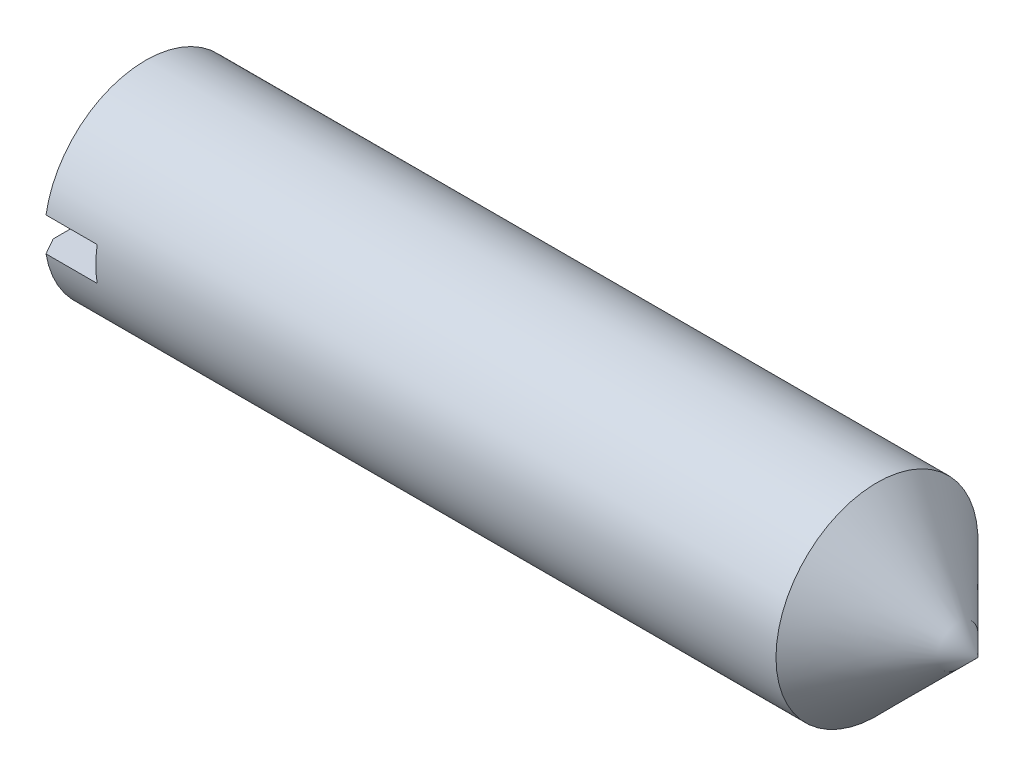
from build123d import *

# Parameters (mm, degrees)
SKETCH2_W  = 12
SKETCH2_H  = 2
SLOT_DEPTH = 3.6


with BuildPart() as part:
    # BodySke → BaseBody (revolve)
    with BuildSketch(Plane.XY, mode=Mode.PRIVATE) as basebody_sk:
        Polygon((0, 0), (0, 5.036), (0.556565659, 6), (44, 6), (50, 0), align=None)
    revolve(basebody_sk.sketch.rotate(Axis((-12.7, 0, 0), (1, 0, 0)), 90), axis=Axis((-12.7, 0, 0), (1, 0, 0)))

    # Sketch2 → Slot (cut)
    with BuildSketch(Plane.ZY):
        Rectangle(SKETCH2_W, SKETCH2_H)
    extrude(amount=-SLOT_DEPTH, mode=Mode.SUBTRACT)


solid = part.part
